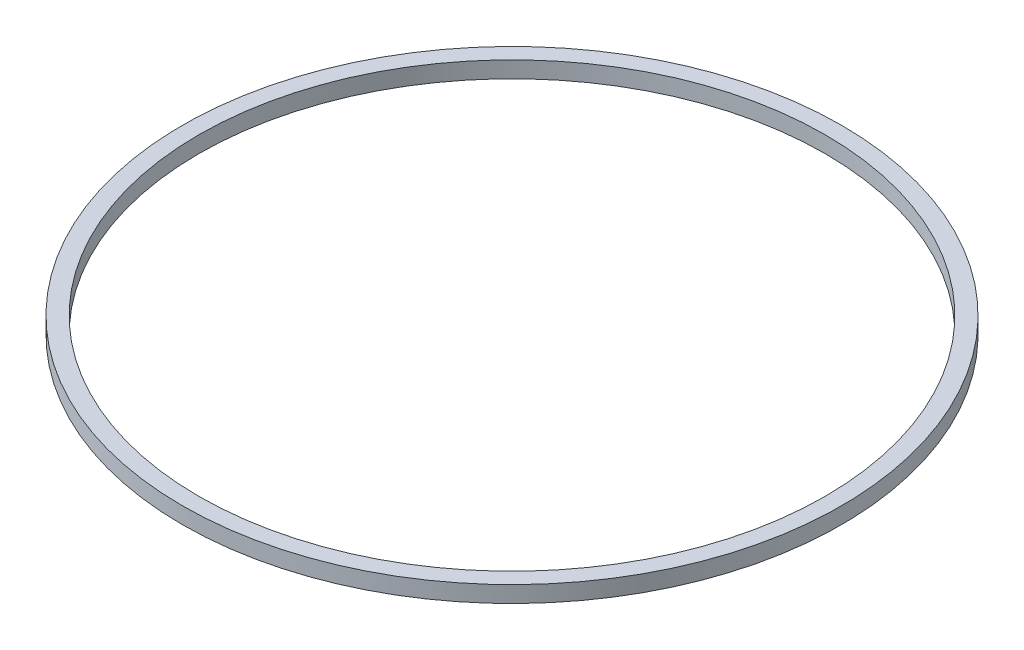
from build123d import *

# Parameters (mm, degrees)
SKETCH1_R           = 80.4
SKETCH1_R_2         = 76.4
BOSS_EXTRUDE1_DEPTH = 4


with BuildPart() as part:
    # Sketch1 → Boss-Extrude1 (new body)
    with BuildSketch(Plane(origin=(0, 0, 0), x_dir=(1, 0, 0), z_dir=(0, 1, 0))):
        with Locations(Location((0, 0, 0), (0, 0, 270))):
            Circle(SKETCH1_R)
        with Locations(Location((0, 0, 0), (0, 0, 270))):
            Circle(SKETCH1_R_2, mode=Mode.SUBTRACT)
    extrude(amount=BOSS_EXTRUDE1_DEPTH)


solid = part.part
